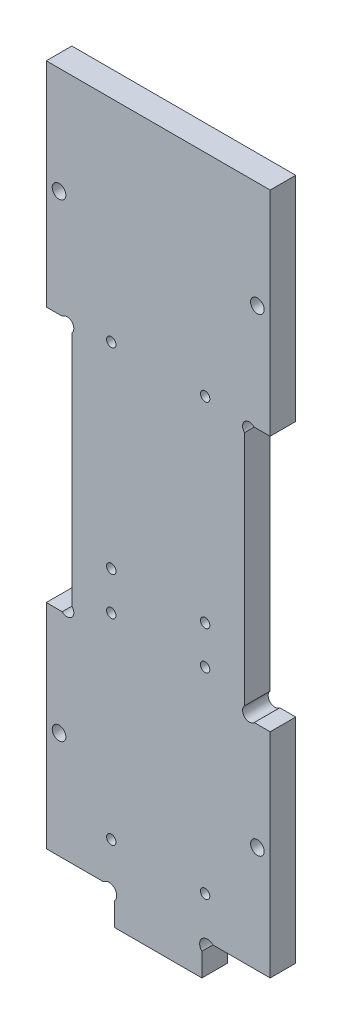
from build123d import *

# Parameters (mm, degrees)
ESQUISSE1_R        = 1.6
ESQUISSE1_R_2      = 1.1
BOSS_EXTRU_1_DEPTH = 6


with BuildPart() as part:
    # Esquisse1 → Boss.-Extru.1 (new body)
    with BuildSketch(Plane.XY):
        with BuildLine():
            Line((48.7627417, 58), (52.5, 58))
            Line((52.5, 58), (52.5, 8))
            Line((52.5, 8), (39.067255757, 8))
            ThreePointArc((39.067255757, 8), (36.5, 8), (36.5, 5.432744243))
            Line((36.5, 5.432744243), (36.5, 0))
            Line((36.5, 0), (16, 0))
            Line((16, 0), (16, 5.432744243))
            ThreePointArc((16, 5.432744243), (16, 8), (13.432744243, 8))
            Line((13.432744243, 8), (0, 8))
            Line((0, 8), (0, 58))
            Line((0, 58), (3.7372583, 58))
            ThreePointArc((3.7372583, 58), (6, 58), (6, 60.2627417))
            Line((6, 60.2627417), (6, 115.7372583))
            ThreePointArc((6, 115.7372583), (6, 118), (3.7372583, 118))
            Line((3.7372583, 118), (0, 118))
            Line((0, 118), (0, 168))
            Line((0, 168), (52.5, 168))
            Line((52.5, 168), (52.5, 118))
            Line((52.5, 118), (48.7627417, 118))
            ThreePointArc((48.7627417, 118), (46.5, 118), (46.5, 115.7372583))
            Line((46.5, 115.7372583), (46.5, 60.2627417))
            ThreePointArc((46.5, 60.2627417), (46.5, 58), (48.7627417, 58))
        make_face()
        with Locations((49.5, 33)):
            Circle(ESQUISSE1_R, mode=Mode.SUBTRACT)
        with Locations(Location((49.5, 143, 0), (0, 0, 180))):
            Circle(ESQUISSE1_R, mode=Mode.SUBTRACT)
        with Locations((3, 143)):
            Circle(ESQUISSE1_R, mode=Mode.SUBTRACT)
        with Locations(Location((3, 33, 0), (0, 0, 180))):
            Circle(ESQUISSE1_R, mode=Mode.SUBTRACT)
        with Locations((15.25, 63.5)):
            Circle(ESQUISSE1_R_2, mode=Mode.SUBTRACT)
        with Locations((37.25, 63.5)):
            Circle(ESQUISSE1_R_2, mode=Mode.SUBTRACT)
        with Locations((37.25, 17.5)):
            Circle(ESQUISSE1_R_2, mode=Mode.SUBTRACT)
        with Locations((15.25, 17.5)):
            Circle(ESQUISSE1_R_2, mode=Mode.SUBTRACT)
        with Locations(Location((15.25, 118.5, 0), (0, 0, 180))):
            Circle(ESQUISSE1_R_2, mode=Mode.SUBTRACT)
        with Locations(Location((37.25, 118.5, 0), (0, 0, 180))):
            Circle(ESQUISSE1_R_2, mode=Mode.SUBTRACT)
        with Locations(Location((37.25, 72.5, 0), (0, 0, 180))):
            Circle(ESQUISSE1_R_2, mode=Mode.SUBTRACT)
        with Locations(Location((15.25, 72.5, 0), (0, 0, 180))):
            Circle(ESQUISSE1_R_2, mode=Mode.SUBTRACT)
    extrude(amount=BOSS_EXTRU_1_DEPTH)


solid = part.part
